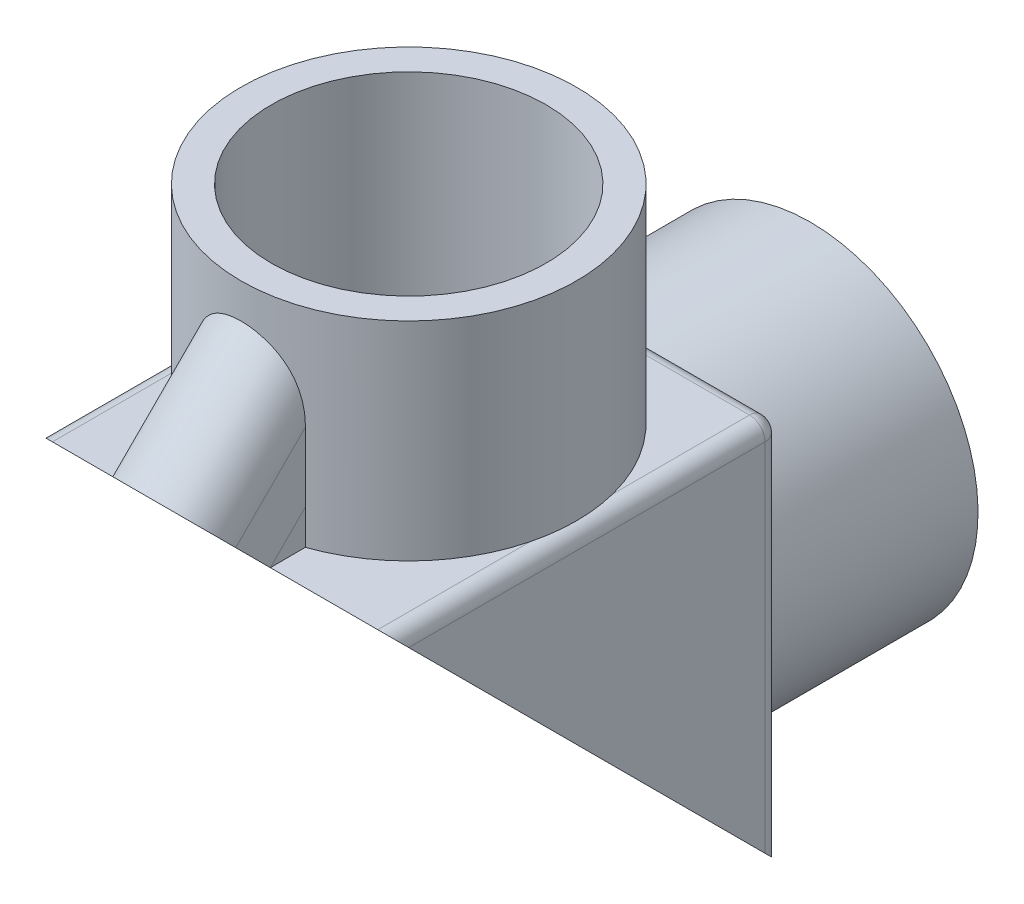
ISO-10303-21;
HEADER;
FILE_DESCRIPTION(('STEP AP214'),'2;1');
FILE_NAME('part.step','',(''),(''),'','','');
FILE_SCHEMA(('AUTOMOTIVE_DESIGN { 1 0 10303 214 1 1 1 1 }'));
ENDSEC;
DATA;
#1=APPLICATION_CONTEXT('core data for automotive mechanical design processes');
#2=APPLICATION_PROTOCOL_DEFINITION('international standard','automotive_design',2000,#1);
#3=PRODUCT_CONTEXT('',#1,'mechanical');
#4=PRODUCT('Part','Part','',(#3));
#5=PRODUCT_RELATED_PRODUCT_CATEGORY('part','',(#4));
#6=PRODUCT_DEFINITION_FORMATION('','',#4);
#7=PRODUCT_DEFINITION_CONTEXT('part definition',#1,'design');
#8=PRODUCT_DEFINITION('design','',#6,#7);
#9=PRODUCT_DEFINITION_SHAPE('','',#8);
#10=(LENGTH_UNIT() NAMED_UNIT(*) SI_UNIT(.MILLI.,.METRE.));
#11=(NAMED_UNIT(*) PLANE_ANGLE_UNIT() SI_UNIT($,.RADIAN.));
#12=(NAMED_UNIT(*) SI_UNIT($,.STERADIAN.) SOLID_ANGLE_UNIT());
#13=UNCERTAINTY_MEASURE_WITH_UNIT(LENGTH_MEASURE(1.E-05),#10,'distance_accuracy_value','');
#14=(GEOMETRIC_REPRESENTATION_CONTEXT(3) GLOBAL_UNCERTAINTY_ASSIGNED_CONTEXT((#13)) GLOBAL_UNIT_ASSIGNED_CONTEXT((#10,
#11,#12)) REPRESENTATION_CONTEXT('',''));
#15=CARTESIAN_POINT('',(0.,0.,0.));
#16=DIRECTION('',(0.,0.,1.));
#17=DIRECTION('',(1.,0.,0.));
#18=AXIS2_PLACEMENT_3D('',#15,#16,#17);
#19=CARTESIAN_POINT('',(17.526,0.,-19.05));
#20=DIRECTION('',(0.,0.,1.));
#21=DIRECTION('',(0.,-1.,0.));
#22=AXIS2_PLACEMENT_3D('',#19,#20,#21);
#23=PLANE('',#22);
#24=CARTESIAN_POINT('',(0.,0.,-19.05));
#25=DIRECTION('',(0.,0.,-1.));
#26=DIRECTION('',(0.,1.,0.));
#27=AXIS2_PLACEMENT_3D('',#24,#25,#26);
#28=CIRCLE('',#27,16.51);
#29=CARTESIAN_POINT('',(-5.4356,-15.5895590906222,-19.05));
#30=VERTEX_POINT('',#29);
#31=CARTESIAN_POINT('',(-16.002,-4.06400000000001,-19.05));
#32=VERTEX_POINT('',#31);
#33=EDGE_CURVE('E442',#30,#32,#28,.T.);
#34=ORIENTED_EDGE('',*,*,#33,.F.);
#35=DIRECTION('',(0.,-1.,0.));
#36=VECTOR('',#35,1.);
#37=CARTESIAN_POINT('',(-5.4356,0.,-19.05));
#38=LINE('',#37,#36);
#39=CARTESIAN_POINT('',(-5.4356,-19.05,-19.05));
#40=VERTEX_POINT('',#39);
#41=EDGE_CURVE('E284',#30,#40,#38,.T.);
#42=ORIENTED_EDGE('',*,*,#41,.T.);
#43=DIRECTION('',(-1.,0.,0.));
#44=VECTOR('',#43,1.);
#45=CARTESIAN_POINT('',(17.526,-19.05,-19.05));
#46=LINE('',#45,#44);
#47=CARTESIAN_POINT('',(-16.002,-19.05,-19.05));
#48=VERTEX_POINT('',#47);
#49=EDGE_CURVE('E355',#40,#48,#46,.T.);
#50=ORIENTED_EDGE('',*,*,#49,.T.);
#51=DIRECTION('',(0.,1.,0.));
#52=VECTOR('',#51,1.);
#53=CARTESIAN_POINT('',(-16.002,19.05,-19.05));
#54=LINE('',#53,#52);
#55=EDGE_CURVE('E232',#48,#32,#54,.T.);
#56=ORIENTED_EDGE('',*,*,#55,.T.);
#57=EDGE_LOOP('',(#34,#42,#50,#56));
#58=FACE_BOUND('',#57,.T.);
#59=ADVANCED_FACE('F38',(#58),#23,.F.);
#60=CARTESIAN_POINT('',(-16.002,4.06400000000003,-19.05));
#61=VERTEX_POINT('',#60);
#62=CARTESIAN_POINT('',(16.002,4.06400000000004,-19.05));
#63=VERTEX_POINT('',#62);
#64=EDGE_CURVE('E192',#61,#63,#28,.T.);
#65=ORIENTED_EDGE('',*,*,#64,.F.);
#66=CARTESIAN_POINT('',(-16.002,17.526,-19.05));
#67=VERTEX_POINT('',#66);
#68=EDGE_CURVE('E226',#61,#67,#54,.T.);
#69=ORIENTED_EDGE('',*,*,#68,.T.);
#70=DIRECTION('',(-1.,0.,0.));
#71=VECTOR('',#70,1.);
#72=CARTESIAN_POINT('',(17.526,17.526,-19.05));
#73=LINE('',#72,#71);
#74=CARTESIAN_POINT('',(16.002,17.526,-19.05));
#75=VERTEX_POINT('',#74);
#76=EDGE_CURVE('E224',#67,#75,#73,.F.);
#77=ORIENTED_EDGE('',*,*,#76,.T.);
#78=DIRECTION('',(0.,1.,0.));
#79=VECTOR('',#78,1.);
#80=CARTESIAN_POINT('',(16.002,0.,-19.05));
#81=LINE('',#80,#79);
#82=EDGE_CURVE('E216',#75,#63,#81,.F.);
#83=ORIENTED_EDGE('',*,*,#82,.T.);
#84=EDGE_LOOP('',(#65,#69,#77,#83));
#85=FACE_BOUND('',#84,.T.);
#86=ADVANCED_FACE('F222',(#85),#23,.F.);
#87=CARTESIAN_POINT('',(16.002,-4.06400000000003,-19.05));
#88=VERTEX_POINT('',#87);
#89=CARTESIAN_POINT('',(5.42419755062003,-15.5935300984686,-19.05));
#90=VERTEX_POINT('',#89);
#91=EDGE_CURVE('E210',#88,#90,#28,.T.);
#92=ORIENTED_EDGE('',*,*,#91,.F.);
#93=CARTESIAN_POINT('',(16.002,-19.05,-19.05));
#94=VERTEX_POINT('',#93);
#95=EDGE_CURVE('E218',#88,#94,#81,.F.);
#96=ORIENTED_EDGE('',*,*,#95,.T.);
#97=CARTESIAN_POINT('',(5.4356,-19.05,-19.05));
#98=VERTEX_POINT('',#97);
#99=EDGE_CURVE('E356',#94,#98,#46,.T.);
#100=ORIENTED_EDGE('',*,*,#99,.T.);
#101=DIRECTION('',(-0.00329885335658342,0.999994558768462,0.));
#102=VECTOR('',#101,1.);
#103=CARTESIAN_POINT('',(5.37288875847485,-0.0400915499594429,-19.05));
#104=LINE('',#103,#102);
#105=EDGE_CURVE('E262',#98,#90,#104,.T.);
#106=ORIENTED_EDGE('',*,*,#105,.T.);
#107=EDGE_LOOP('',(#92,#96,#100,#106));
#108=FACE_BOUND('',#107,.T.);
#109=ADVANCED_FACE('F428',(#108),#23,.F.);
#110=CARTESIAN_POINT('',(-5.4356,-10.0578868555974,-34.8433937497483));
#111=DIRECTION('',(-1.,0.,0.));
#112=DIRECTION('',(0.,0.,1.));
#113=AXIS2_PLACEMENT_3D('',#110,#111,#112);
#114=PLANE('',#113);
#115=ORIENTED_EDGE('',*,*,#41,.F.);
#116=DIRECTION('',(0.,0.,1.));
#117=VECTOR('',#116,1.);
#118=CARTESIAN_POINT('',(-5.4356,-15.5895590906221,-39.497));
#119=LINE('',#118,#117);
#120=CARTESIAN_POINT('',(-5.4356,-15.5895590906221,-29.3117215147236));
#121=VERTEX_POINT('',#120);
#122=EDGE_CURVE('E379',#30,#121,#119,.F.);
#123=ORIENTED_EDGE('',*,*,#122,.T.);
#124=DIRECTION('',(0.,-0.707106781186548,0.707106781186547));
#125=VECTOR('',#124,1.);
#126=CARTESIAN_POINT('',(-5.4356,-10.0578868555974,-34.8433937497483));
#127=LINE('',#126,#125);
#128=CARTESIAN_POINT('',(-5.4356,-22.4506403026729,-22.4506403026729));
#129=VERTEX_POINT('',#128);
#130=EDGE_CURVE('E323',#121,#129,#127,.T.);
#131=ORIENTED_EDGE('',*,*,#130,.T.);
#132=DIRECTION('',(0.,-0.707106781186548,-0.707106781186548));
#133=VECTOR('',#132,1.);
#134=CARTESIAN_POINT('',(-5.4356,-22.4506403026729,-22.4506403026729));
#135=LINE('',#134,#133);
#136=EDGE_CURVE('E319',#40,#129,#135,.T.);
#137=ORIENTED_EDGE('',*,*,#136,.F.);
#138=EDGE_LOOP('',(#115,#123,#131,#137));
#139=FACE_BOUND('',#138,.T.);
#140=ADVANCED_FACE('F435',(#139),#114,.T.);
#141=CARTESIAN_POINT('',(5.4158758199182,-3.66771191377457,-28.4532188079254));
#142=DIRECTION('',(0.999989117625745,0.00329883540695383,0.00329883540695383));
#143=DIRECTION('',(0.00329885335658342,0.,-0.999994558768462));
#144=AXIS2_PLACEMENT_3D('',#141,#142,#143);
#145=PLANE('',#144);
#146=DIRECTION('',(0.,-0.707106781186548,0.707106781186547));
#147=VECTOR('',#146,1.);
#148=CARTESIAN_POINT('',(5.4356,-6.65724655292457,-31.4427534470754));
#149=LINE('',#148,#147);
#150=CARTESIAN_POINT('',(5.4356,-15.5895590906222,-22.5104409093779));
#151=VERTEX_POINT('',#150);
#152=EDGE_CURVE('E326',#151,#98,#149,.T.);
#153=ORIENTED_EDGE('',*,*,#152,.F.);
#154=CARTESIAN_POINT('',(0.,-5.86296497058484E-13,1609.61508039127));
#155=DIRECTION('',(0.999989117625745,0.00329883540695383,0.00329883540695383));
#156=DIRECTION('',(-0.00329881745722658,-1.08823742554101E-05,0.999994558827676));
#157=AXIS2_PLACEMENT_3D('',#154,#155,#156);
#158=ELLIPSE('',#157,5004.79653067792,16.51);
#159=EDGE_CURVE('E53',#151,#90,#158,.F.);
#160=ORIENTED_EDGE('',*,*,#159,.T.);
#161=ORIENTED_EDGE('',*,*,#105,.F.);
#162=EDGE_LOOP('',(#153,#160,#161));
#163=FACE_BOUND('',#162,.T.);
#164=ADVANCED_FACE('F439',(#163),#145,.T.);
#165=CARTESIAN_POINT('',(0.,-10.0578868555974,-34.8433937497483));
#166=DIRECTION('',(0.,-0.707106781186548,0.707106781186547));
#167=DIRECTION('',(0.,-0.707106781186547,-0.707106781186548));
#168=AXIS2_PLACEMENT_3D('',#165,#166,#167);
#169=CYLINDRICAL_SURFACE('',#168,5.4356);
#170=ORIENTED_EDGE('',*,*,#130,.F.);
#171=CARTESIAN_POINT('',(-5.4356,-15.5895590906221,-29.3117215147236));
#172=CARTESIAN_POINT('',(-5.43556749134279,-15.5895406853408,-29.5403712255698));
#173=CARTESIAN_POINT('',(-5.42838212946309,-15.5920737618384,-29.769107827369));
#174=CARTESIAN_POINT('',(-5.39849313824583,-15.6024637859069,-30.2258273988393));
#175=CARTESIAN_POINT('',(-5.37576257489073,-15.6103299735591,-30.4538083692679));
#176=CARTESIAN_POINT('',(-5.31329210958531,-15.6317011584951,-30.909256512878));
#177=CARTESIAN_POINT('',(-5.27340608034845,-15.6452545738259,-31.1367019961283));
#178=CARTESIAN_POINT('',(-5.17531126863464,-15.6779749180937,-31.5869895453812));
#179=CARTESIAN_POINT('',(-5.11711540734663,-15.6971378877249,-31.8098347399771));
#180=CARTESIAN_POINT('',(-4.94511362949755,-15.75240232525,-32.3644789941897));
#181=CARTESIAN_POINT('',(-4.81815105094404,-15.7921156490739,-32.6920940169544));
#182=CARTESIAN_POINT('',(-4.59060463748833,-15.8591458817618,-33.1637758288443));
#183=CARTESIAN_POINT('',(-4.50866442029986,-15.8827075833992,-33.3175805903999));
#184=CARTESIAN_POINT('',(-4.33212866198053,-15.9317667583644,-33.6173903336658));
#185=CARTESIAN_POINT('',(-4.23753955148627,-15.9572632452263,-33.7633992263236));
#186=CARTESIAN_POINT('',(-4.03453965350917,-16.0097995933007,-34.0476390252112));
#187=CARTESIAN_POINT('',(-3.92599058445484,-16.0368531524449,-34.1857688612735));
#188=CARTESIAN_POINT('',(-3.69617254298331,-16.0913747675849,-34.4508286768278));
#189=CARTESIAN_POINT('',(-3.57491010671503,-16.1188426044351,-34.5777643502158));
#190=CARTESIAN_POINT('',(-3.32014987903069,-16.1732392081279,-34.8189370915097));
#191=CARTESIAN_POINT('',(-3.18664847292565,-16.2001678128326,-34.9331703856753));
#192=CARTESIAN_POINT('',(-2.90836635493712,-16.2524313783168,-35.1473677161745));
#193=CARTESIAN_POINT('',(-2.7635877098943,-16.2777666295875,-35.2473343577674));
#194=CARTESIAN_POINT('',(-2.48530467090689,-16.3223866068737,-35.4185577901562));
#195=CARTESIAN_POINT('',(-2.35312004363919,-16.342019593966,-35.491875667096));
#196=CARTESIAN_POINT('',(-2.08234478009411,-16.3787238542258,-35.6262978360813));
#197=CARTESIAN_POINT('',(-1.94375491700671,-16.3957954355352,-35.6874035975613));
#198=CARTESIAN_POINT('',(-1.66133506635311,-16.4268145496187,-35.7967756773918));
#199=CARTESIAN_POINT('',(-1.51750757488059,-16.4407635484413,-35.8450480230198));
#200=CARTESIAN_POINT('',(-1.22576582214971,-16.4650847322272,-35.9283204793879));
#201=CARTESIAN_POINT('',(-1.07785179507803,-16.4754571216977,-35.9633213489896));
#202=CARTESIAN_POINT('',(-0.792909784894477,-16.4915087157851,-36.0171366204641));
#203=CARTESIAN_POINT('',(-0.656124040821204,-16.4975304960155,-36.0371390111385));
#204=CARTESIAN_POINT('',(-0.38126291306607,-16.5061697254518,-36.0657618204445));
#205=CARTESIAN_POINT('',(-0.243187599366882,-16.5087873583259,-36.0743828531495));
#206=CARTESIAN_POINT('',(0.0331911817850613,-16.5105448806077,-36.080175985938));
#207=CARTESIAN_POINT('',(0.171494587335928,-16.5096855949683,-36.0773508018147));
#208=CARTESIAN_POINT('',(0.447330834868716,-16.5045152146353,-36.0602795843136));
#209=CARTESIAN_POINT('',(0.584863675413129,-16.5002041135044,-36.046033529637));
#210=CARTESIAN_POINT('',(0.854860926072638,-16.4883939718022,-36.0067086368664));
#211=CARTESIAN_POINT('',(0.987367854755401,-16.4809737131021,-35.9818972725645));
#212=CARTESIAN_POINT('',(1.2497926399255,-16.463153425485,-35.9216757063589));
#213=CARTESIAN_POINT('',(1.37970961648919,-16.4527524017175,-35.8862619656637));
#214=CARTESIAN_POINT('',(1.63596934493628,-16.4292499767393,-35.8051241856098));
#215=CARTESIAN_POINT('',(1.76231356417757,-16.4161497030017,-35.7594044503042));
#216=CARTESIAN_POINT('',(2.01070267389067,-16.3875810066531,-35.6579792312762));
#217=CARTESIAN_POINT('',(2.13274594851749,-16.3721117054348,-35.6022700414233));
#218=CARTESIAN_POINT('',(2.37328546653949,-16.3389886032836,-35.480521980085));
#219=CARTESIAN_POINT('',(2.49171478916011,-16.3213089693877,-35.4143579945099));
#220=CARTESIAN_POINT('',(2.72268021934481,-16.2843728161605,-35.272745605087));
#221=CARTESIAN_POINT('',(2.83521417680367,-16.2651157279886,-35.1972938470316));
#222=CARTESIAN_POINT('',(3.05372170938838,-16.2255111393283,-35.0377534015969));
#223=CARTESIAN_POINT('',(3.15969718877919,-16.2051639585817,-34.9536672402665));
#224=CARTESIAN_POINT('',(3.36468521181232,-16.16384644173,-34.7774787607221));
#225=CARTESIAN_POINT('',(3.46369519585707,-16.1428758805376,-34.6853735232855));
#226=CARTESIAN_POINT('',(3.65982433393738,-16.0995790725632,-34.4883893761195));
#227=CARTESIAN_POINT('',(3.75651066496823,-16.0772439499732,-34.3830810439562));
#228=CARTESIAN_POINT('',(3.94141558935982,-16.0329153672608,-34.1651875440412));
#229=CARTESIAN_POINT('',(4.02963075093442,-16.0109220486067,-34.0525994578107));
#230=CARTESIAN_POINT('',(4.28131098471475,-15.9461782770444,-33.7052347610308));
#231=CARTESIAN_POINT('',(4.43193055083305,-15.9046365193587,-33.4607358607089));
#232=CARTESIAN_POINT('',(4.65826078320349,-15.8395071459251,-33.0305836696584));
#233=CARTESIAN_POINT('',(4.74281754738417,-15.8143034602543,-32.8496721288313));
#234=CARTESIAN_POINT('',(4.89613595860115,-15.7675105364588,-32.4807255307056));
#235=CARTESIAN_POINT('',(4.96489172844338,-15.7459226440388,-32.2926878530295));
#236=CARTESIAN_POINT('',(5.08745704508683,-15.706751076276,-31.9109631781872));
#237=CARTESIAN_POINT('',(5.14123203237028,-15.6891766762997,-31.7172642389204));
#238=CARTESIAN_POINT('',(5.23454758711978,-15.6582888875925,-31.3261179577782));
#239=CARTESIAN_POINT('',(5.27408405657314,-15.6449767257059,-31.1286695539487));
#240=CARTESIAN_POINT('',(5.35127031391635,-15.6187790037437,-30.662101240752));
#241=CARTESIAN_POINT('',(5.38346941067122,-15.6076560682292,-30.3919650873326));
#242=CARTESIAN_POINT('',(5.41506943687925,-15.5967051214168,-29.9863874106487));
#243=CARTESIAN_POINT('',(5.42282131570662,-15.5940099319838,-29.8515873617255));
#244=CARTESIAN_POINT('',(5.43308392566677,-15.590436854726,-29.5817703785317));
#245=CARTESIAN_POINT('',(5.43559497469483,-15.5895588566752,-29.4467534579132));
#246=CARTESIAN_POINT('',(5.4356,-15.5895590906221,-29.3117215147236));
#247=B_SPLINE_CURVE_WITH_KNOTS('',3,(#171,#172,#173,#174,#175,#176,#177,#178,#179,#180,#181,
#182,#183,#184,#185,#186,#187,#188,#189,#190,#191,#192,#193,#194,#195,#196,#197,#198,#199,#200,
#201,#202,#203,#204,#205,#206,#207,#208,#209,#210,#211,#212,#213,#214,#215,#216,#217,#218,#219,
#220,#221,#222,#223,#224,#225,#226,#227,#228,#229,#230,#231,#232,#233,#234,#235,#236,#237,#238,
#239,#240,#241,#242,#243,#244,#245,#246),.UNSPECIFIED.,.F.,.F.,(4,2,2,2,2,2,2,2,2,2,2,2,2,2,2,2,
2,2,2,2,2,2,2,2,2,2,2,2,2,2,2,2,2,2,2,2,2,4),(0.,0.68594893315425,1.37308938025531,
2.0662024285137,2.75882744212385,3.81487612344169,4.3419320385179,4.86872101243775,
5.40120111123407,5.93340878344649,6.4657741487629,6.99804217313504,7.45470328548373,
7.91130941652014,8.36770071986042,8.8240659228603,9.23867543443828,9.65326257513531,
10.0677513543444,10.4822409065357,10.8868085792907,11.2915114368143,11.6960455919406,
12.1007301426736,12.5106866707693,12.9207916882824,13.3307770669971,13.7409123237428,
14.1745297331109,14.608322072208,15.4753928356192,16.0785345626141,16.6819002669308,
17.2866465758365,17.8915667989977,18.7071247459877,19.1121835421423,19.5172177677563),.UNSPECIFIED.);
#248=CARTESIAN_POINT('',(5.4356,-15.5895590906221,-29.3117215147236));
#249=VERTEX_POINT('',#248);
#250=EDGE_CURVE('E446',#121,#249,#247,.T.);
#251=ORIENTED_EDGE('',*,*,#250,.T.);
#252=DIRECTION('',(0.,-0.707106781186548,0.707106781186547));
#253=VECTOR('',#252,1.);
#254=CARTESIAN_POINT('',(5.4356,-10.0578868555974,-34.8433937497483));
#255=LINE('',#254,#253);
#256=CARTESIAN_POINT('',(5.4356,-22.4506403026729,-22.4506403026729));
#257=VERTEX_POINT('',#256);
#258=EDGE_CURVE('E322',#249,#257,#255,.T.);
#259=ORIENTED_EDGE('',*,*,#258,.T.);
#260=CARTESIAN_POINT('',(0.,-22.4506403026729,-22.4506403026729));
#261=DIRECTION('',(0.,-0.707106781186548,0.707106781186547));
#262=DIRECTION('',(0.,-0.707106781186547,-0.707106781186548));
#263=AXIS2_PLACEMENT_3D('',#260,#261,#262);
#264=CIRCLE('',#263,5.4356);
#265=EDGE_CURVE('E308',#129,#257,#264,.T.);
#266=ORIENTED_EDGE('',*,*,#265,.F.);
#267=EDGE_LOOP('',(#170,#251,#259,#266));
#268=FACE_BOUND('',#267,.T.);
#269=ADVANCED_FACE('F454',(#268),#169,.T.);
#270=CARTESIAN_POINT('',(5.4356,-10.0578868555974,-34.8433937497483));
#271=DIRECTION('',(1.,0.,0.));
#272=DIRECTION('',(0.,0.,-1.));
#273=AXIS2_PLACEMENT_3D('',#270,#271,#272);
#274=PLANE('',#273);
#275=ORIENTED_EDGE('',*,*,#258,.F.);
#276=DIRECTION('',(0.,0.,1.));
#277=VECTOR('',#276,1.);
#278=CARTESIAN_POINT('',(5.4356,-15.5895590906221,-39.497));
#279=LINE('',#278,#277);
#280=EDGE_CURVE('E11',#249,#151,#279,.T.);
#281=ORIENTED_EDGE('',*,*,#280,.T.);
#282=ORIENTED_EDGE('',*,*,#152,.T.);
#283=DIRECTION('',(0.,0.707106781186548,0.707106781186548));
#284=VECTOR('',#283,1.);
#285=CARTESIAN_POINT('',(5.4356,-22.4506403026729,-22.4506403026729));
#286=LINE('',#285,#284);
#287=EDGE_CURVE('E316',#257,#98,#286,.T.);
#288=ORIENTED_EDGE('',*,*,#287,.F.);
#289=EDGE_LOOP('',(#275,#281,#282,#288));
#290=FACE_BOUND('',#289,.T.);
#291=ADVANCED_FACE('F682',(#290),#274,.T.);
#292=CARTESIAN_POINT('',(17.526,19.05,0.));
#293=DIRECTION('',(0.,-1.,0.));
#294=DIRECTION('',(0.,0.,-1.));
#295=AXIS2_PLACEMENT_3D('',#292,#293,#294);
#296=PLANE('',#295);
#297=CARTESIAN_POINT('',(0.,19.05,0.));
#298=DIRECTION('',(0.,1.,0.));
#299=DIRECTION('',(0.,0.,1.));
#300=AXIS2_PLACEMENT_3D('',#297,#298,#299);
#301=CIRCLE('',#300,16.51);
#302=CARTESIAN_POINT('',(-16.002,19.05,4.06400000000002));
#303=VERTEX_POINT('',#302);
#304=CARTESIAN_POINT('',(-5.4356,19.05,15.5895590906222));
#305=VERTEX_POINT('',#304);
#306=EDGE_CURVE('E219',#303,#305,#301,.T.);
#307=ORIENTED_EDGE('',*,*,#306,.F.);
#308=DIRECTION('',(0.,0.,1.));
#309=VECTOR('',#308,1.);
#310=CARTESIAN_POINT('',(-16.002,19.05,19.05));
#311=LINE('',#310,#309);
#312=CARTESIAN_POINT('',(-16.002,19.05,19.05));
#313=VERTEX_POINT('',#312);
#314=EDGE_CURVE('E254',#303,#313,#311,.T.);
#315=ORIENTED_EDGE('',*,*,#314,.T.);
#316=DIRECTION('',(-1.,0.,0.));
#317=VECTOR('',#316,1.);
#318=CARTESIAN_POINT('',(17.526,19.05,19.05));
#319=LINE('',#318,#317);
#320=CARTESIAN_POINT('',(-5.4356,19.05,19.05));
#321=VERTEX_POINT('',#320);
#322=EDGE_CURVE('E358',#321,#313,#319,.T.);
#323=ORIENTED_EDGE('',*,*,#322,.F.);
#324=DIRECTION('',(0.,0.,-1.));
#325=VECTOR('',#324,1.);
#326=CARTESIAN_POINT('',(-5.4356,19.05,0.));
#327=LINE('',#326,#325);
#328=EDGE_CURVE('E288',#321,#305,#327,.T.);
#329=ORIENTED_EDGE('',*,*,#328,.T.);
#330=EDGE_LOOP('',(#307,#315,#323,#329));
#331=FACE_BOUND('',#330,.T.);
#332=ADVANCED_FACE('F425',(#331),#296,.F.);
#333=CARTESIAN_POINT('',(5.42419755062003,19.05,15.5935300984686));
#334=VERTEX_POINT('',#333);
#335=CARTESIAN_POINT('',(16.002,19.05,4.06400000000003));
#336=VERTEX_POINT('',#335);
#337=EDGE_CURVE('E388',#334,#336,#301,.T.);
#338=ORIENTED_EDGE('',*,*,#337,.F.);
#339=DIRECTION('',(0.00329885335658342,0.,0.999994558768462));
#340=VECTOR('',#339,1.);
#341=CARTESIAN_POINT('',(5.37288875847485,19.05,0.0400915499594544));
#342=LINE('',#341,#340);
#343=CARTESIAN_POINT('',(5.4356,19.05,19.05));
#344=VERTEX_POINT('',#343);
#345=EDGE_CURVE('E286',#334,#344,#342,.T.);
#346=ORIENTED_EDGE('',*,*,#345,.T.);
#347=CARTESIAN_POINT('',(16.002,19.05,19.05));
#348=VERTEX_POINT('',#347);
#349=EDGE_CURVE('E228',#348,#344,#319,.T.);
#350=ORIENTED_EDGE('',*,*,#349,.F.);
#351=DIRECTION('',(0.,0.,1.));
#352=VECTOR('',#351,1.);
#353=CARTESIAN_POINT('',(16.002,19.05,0.));
#354=LINE('',#353,#352);
#355=EDGE_CURVE('E249',#348,#336,#354,.F.);
#356=ORIENTED_EDGE('',*,*,#355,.T.);
#357=EDGE_LOOP('',(#338,#346,#350,#356));
#358=FACE_BOUND('',#357,.T.);
#359=ADVANCED_FACE('F422',(#358),#296,.F.);
#360=CARTESIAN_POINT('',(16.002,19.05,-4.06400000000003));
#361=VERTEX_POINT('',#360);
#362=CARTESIAN_POINT('',(-16.002,19.05,-4.06400000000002));
#363=VERTEX_POINT('',#362);
#364=EDGE_CURVE('E624',#361,#363,#301,.T.);
#365=ORIENTED_EDGE('',*,*,#364,.F.);
#366=CARTESIAN_POINT('',(16.002,19.05,-17.526));
#367=VERTEX_POINT('',#366);
#368=EDGE_CURVE('E248',#361,#367,#354,.F.);
#369=ORIENTED_EDGE('',*,*,#368,.T.);
#370=DIRECTION('',(-1.,0.,0.));
#371=VECTOR('',#370,1.);
#372=CARTESIAN_POINT('',(17.526,19.05,-17.526));
#373=LINE('',#372,#371);
#374=CARTESIAN_POINT('',(-16.002,19.05,-17.526));
#375=VERTEX_POINT('',#374);
#376=EDGE_CURVE('E252',#367,#375,#373,.T.);
#377=ORIENTED_EDGE('',*,*,#376,.T.);
#378=EDGE_CURVE('E255',#375,#363,#311,.T.);
#379=ORIENTED_EDGE('',*,*,#378,.T.);
#380=EDGE_LOOP('',(#365,#369,#377,#379));
#381=FACE_BOUND('',#380,.T.);
#382=ADVANCED_FACE('F414',(#381),#296,.F.);
#383=CARTESIAN_POINT('',(-5.4356,31.4427534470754,6.65724655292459));
#384=DIRECTION('',(-1.,0.,0.));
#385=DIRECTION('',(0.,0.,1.));
#386=AXIS2_PLACEMENT_3D('',#383,#384,#385);
#387=PLANE('',#386);
#388=DIRECTION('',(0.,-0.707106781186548,0.707106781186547));
#389=VECTOR('',#388,1.);
#390=CARTESIAN_POINT('',(-5.4356,34.8433937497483,10.0578868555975));
#391=LINE('',#390,#389);
#392=CARTESIAN_POINT('',(-5.4356,29.3117215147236,15.5895590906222));
#393=VERTEX_POINT('',#392);
#394=CARTESIAN_POINT('',(-5.4356,22.4506403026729,22.4506403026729));
#395=VERTEX_POINT('',#394);
#396=EDGE_CURVE('E306',#393,#395,#391,.T.);
#397=ORIENTED_EDGE('',*,*,#396,.F.);
#398=DIRECTION('',(0.,-1.,0.));
#399=VECTOR('',#398,1.);
#400=CARTESIAN_POINT('',(-5.4356,39.497,15.5895590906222));
#401=LINE('',#400,#399);
#402=EDGE_CURVE('E606',#393,#305,#401,.T.);
#403=ORIENTED_EDGE('',*,*,#402,.T.);
#404=ORIENTED_EDGE('',*,*,#328,.F.);
#405=DIRECTION('',(0.,-0.707106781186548,-0.707106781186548));
#406=VECTOR('',#405,1.);
#407=CARTESIAN_POINT('',(-5.4356,19.05,19.05));
#408=LINE('',#407,#406);
#409=EDGE_CURVE('E310',#395,#321,#408,.T.);
#410=ORIENTED_EDGE('',*,*,#409,.F.);
#411=EDGE_LOOP('',(#397,#403,#404,#410));
#412=FACE_BOUND('',#411,.T.);
#413=ADVANCED_FACE('F411',(#412),#387,.T.);
#414=CARTESIAN_POINT('',(5.4158758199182,28.4532188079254,3.66771191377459));
#415=DIRECTION('',(0.999989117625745,-0.00329883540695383,-0.00329883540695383));
#416=DIRECTION('',(-0.00329885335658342,0.,-0.999994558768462));
#417=AXIS2_PLACEMENT_3D('',#414,#415,#416);
#418=PLANE('',#417);
#419=ORIENTED_EDGE('',*,*,#345,.F.);
#420=CARTESIAN_POINT('',(0.,-1609.61508039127,0.));
#421=DIRECTION('',(0.999989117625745,-0.00329883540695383,-0.00329883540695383));
#422=DIRECTION('',(-0.00329881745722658,-0.999994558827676,1.08823742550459E-05));
#423=AXIS2_PLACEMENT_3D('',#420,#421,#422);
#424=ELLIPSE('',#423,5004.79653067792,16.51);
#425=CARTESIAN_POINT('',(5.4356,22.5104409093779,15.5895590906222));
#426=VERTEX_POINT('',#425);
#427=EDGE_CURVE('E398',#334,#426,#424,.F.);
#428=ORIENTED_EDGE('',*,*,#427,.T.);
#429=DIRECTION('',(0.,-0.707106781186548,0.707106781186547));
#430=VECTOR('',#429,1.);
#431=CARTESIAN_POINT('',(5.4356,31.4427534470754,6.65724655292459));
#432=LINE('',#431,#430);
#433=EDGE_CURVE('E298',#426,#344,#432,.T.);
#434=ORIENTED_EDGE('',*,*,#433,.T.);
#435=EDGE_LOOP('',(#419,#428,#434));
#436=FACE_BOUND('',#435,.T.);
#437=ADVANCED_FACE('F413',(#436),#418,.T.);
#438=CARTESIAN_POINT('',(0.,34.8433937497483,10.0578868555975));
#439=DIRECTION('',(0.,-0.707106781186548,0.707106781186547));
#440=DIRECTION('',(0.,-0.707106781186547,-0.707106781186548));
#441=AXIS2_PLACEMENT_3D('',#438,#439,#440);
#442=CYLINDRICAL_SURFACE('',#441,5.4356);
#443=DIRECTION('',(0.,-0.707106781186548,0.707106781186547));
#444=VECTOR('',#443,1.);
#445=CARTESIAN_POINT('',(5.4356,34.8433937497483,10.0578868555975));
#446=LINE('',#445,#444);
#447=CARTESIAN_POINT('',(5.4356,29.3117215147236,15.5895590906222));
#448=VERTEX_POINT('',#447);
#449=CARTESIAN_POINT('',(5.4356,22.4506403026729,22.4506403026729));
#450=VERTEX_POINT('',#449);
#451=EDGE_CURVE('E295',#448,#450,#446,.T.);
#452=ORIENTED_EDGE('',*,*,#451,.F.);
#453=CARTESIAN_POINT('',(0.,20.7041813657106,16.51));
#454=CARTESIAN_POINT('',(0.0915489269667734,20.7041801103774,16.5100002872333));
#455=CARTESIAN_POINT('',(0.183086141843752,20.7082243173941,16.5092361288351));
#456=CARTESIAN_POINT('',(0.365442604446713,20.7242779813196,16.5062074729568));
#457=CARTESIAN_POINT('',(0.456261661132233,20.736289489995,16.503942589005));
#458=CARTESIAN_POINT('',(0.72676991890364,20.7839240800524,16.4949795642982));
#459=CARTESIAN_POINT('',(0.904439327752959,20.8311469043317,16.4861131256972));
#460=CARTESIAN_POINT('',(1.28875461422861,20.9661193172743,16.4609940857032));
#461=CARTESIAN_POINT('',(1.49290322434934,21.0606052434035,16.4435269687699));
#462=CARTESIAN_POINT('',(1.88300800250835,21.2808657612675,16.4034458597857));
#463=CARTESIAN_POINT('',(2.06893162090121,21.4066949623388,16.3808228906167));
#464=CARTESIAN_POINT('',(2.37865956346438,21.6479001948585,16.3383036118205));
#465=CARTESIAN_POINT('',(2.50653140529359,21.7582991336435,16.319094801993));
#466=CARTESIAN_POINT('',(2.75206137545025,21.9898112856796,16.2794880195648));
#467=CARTESIAN_POINT('',(2.86971414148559,22.1109300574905,16.2590894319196));
#468=CARTESIAN_POINT('',(3.09548555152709,22.3619524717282,16.2176221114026));
#469=CARTESIAN_POINT('',(3.2035878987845,22.4918704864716,16.19655231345));
#470=CARTESIAN_POINT('',(3.41069286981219,22.7587600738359,16.1542079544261));
#471=CARTESIAN_POINT('',(3.50969238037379,22.8957340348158,16.1329333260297));
#472=CARTESIAN_POINT('',(3.75947294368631,23.2645349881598,16.0770575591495));
#473=CARTESIAN_POINT('',(3.90310451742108,23.5012427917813,16.0425932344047));
#474=CARTESIAN_POINT('',(4.16962333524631,23.9863366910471,15.975393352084));
#475=CARTESIAN_POINT('',(4.29249755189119,24.2347299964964,15.9426588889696));
#476=CARTESIAN_POINT('',(4.51905153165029,24.7408467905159,15.8799274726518));
#477=CARTESIAN_POINT('',(4.62270395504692,24.9985829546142,15.8499344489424));
#478=CARTESIAN_POINT('',(4.81145623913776,25.5210638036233,15.7936592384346));
#479=CARTESIAN_POINT('',(4.89655990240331,25.7858070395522,15.7673762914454));
#480=CARTESIAN_POINT('',(5.05251843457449,26.334661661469,15.7181165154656));
#481=CARTESIAN_POINT('',(5.12241242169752,26.6190678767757,15.6953800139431));
#482=CARTESIAN_POINT('',(5.24193461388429,27.192569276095,15.6558673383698));
#483=CARTESIAN_POINT('',(5.29155965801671,27.4816651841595,15.6390920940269));
#484=CARTESIAN_POINT('',(5.36971671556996,28.0626570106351,15.6124292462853));
#485=CARTESIAN_POINT('',(5.39827528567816,28.3545489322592,15.6025329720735));
#486=CARTESIAN_POINT('',(5.43307169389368,28.9397993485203,15.5904521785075));
#487=CARTESIAN_POINT('',(5.43931620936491,29.2331573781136,15.5882653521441));
#488=CARTESIAN_POINT('',(5.42900653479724,29.7498592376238,15.591856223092));
#489=CARTESIAN_POINT('',(5.41750434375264,29.9733207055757,15.5958693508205));
#490=CARTESIAN_POINT('',(5.37938652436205,30.4188244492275,15.6090589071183));
#491=CARTESIAN_POINT('',(5.35277135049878,30.6408667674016,15.6182351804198));
#492=CARTESIAN_POINT('',(5.28329017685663,31.0818922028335,15.6418767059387));
#493=CARTESIAN_POINT('',(5.24044365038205,31.3008786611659,15.6563356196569));
#494=CARTESIAN_POINT('',(5.1373146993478,31.7341996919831,15.6904749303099));
#495=CARTESIAN_POINT('',(5.07703628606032,31.9485353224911,15.7101541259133));
#496=CARTESIAN_POINT('',(4.89762568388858,32.4920769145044,15.7672746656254));
#497=CARTESIAN_POINT('',(4.76457318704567,32.816581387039,15.8084269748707));
#498=CARTESIAN_POINT('',(4.52753468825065,33.2829668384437,15.8772834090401));
#499=CARTESIAN_POINT('',(4.44223553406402,33.4350921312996,15.9014350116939));
#500=CARTESIAN_POINT('',(4.25891493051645,33.7311319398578,15.9515143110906));
#501=CARTESIAN_POINT('',(4.16090011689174,33.8750506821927,15.9774410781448));
#502=CARTESIAN_POINT('',(3.95111733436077,34.1545096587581,16.030613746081));
#503=CARTESIAN_POINT('',(3.83922415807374,34.289954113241,16.0578700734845));
#504=CARTESIAN_POINT('',(3.60282831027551,34.5492194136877,16.1125550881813));
#505=CARTESIAN_POINT('',(3.47833221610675,34.6730462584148,16.1399836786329));
#506=CARTESIAN_POINT('',(3.21738236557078,34.9075212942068,16.194020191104));
#507=CARTESIAN_POINT('',(3.08093245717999,35.0181736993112,16.2206283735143));
#508=CARTESIAN_POINT('',(2.79705469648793,35.2248563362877,16.2719810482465));
#509=CARTESIAN_POINT('',(2.6496289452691,35.3208893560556,16.2967258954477));
#510=CARTESIAN_POINT('',(2.36796712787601,35.4838401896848,16.3398281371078));
#511=CARTESIAN_POINT('',(2.23506409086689,35.5529644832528,16.3585870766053));
#512=CARTESIAN_POINT('',(1.96327576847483,35.6790459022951,16.3934257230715));
#513=CARTESIAN_POINT('',(1.82439123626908,35.7360045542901,16.4095057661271));
#514=CARTESIAN_POINT('',(1.54179451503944,35.8371891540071,16.4384651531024));
#515=CARTESIAN_POINT('',(1.39808416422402,35.8814198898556,16.4513457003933));
#516=CARTESIAN_POINT('',(1.10699089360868,35.9567564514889,16.4734929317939));
#517=CARTESIAN_POINT('',(0.959608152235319,35.987862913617,16.4827597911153));
#518=CARTESIAN_POINT('',(0.675259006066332,36.0345590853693,16.4967455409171));
#519=CARTESIAN_POINT('',(0.538488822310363,36.0512545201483,16.5017874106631));
#520=CARTESIAN_POINT('',(0.263906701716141,36.0733207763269,16.5084619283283));
#521=CARTESIAN_POINT('',(0.126094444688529,36.0786879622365,16.5100934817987));
#522=CARTESIAN_POINT('',(-0.149417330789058,36.0780445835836,16.5098982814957));
#523=CARTESIAN_POINT('',(-0.287116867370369,36.0720408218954,16.5080735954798));
#524=CARTESIAN_POINT('',(-0.561516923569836,36.0487109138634,16.501019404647));
#525=CARTESIAN_POINT('',(-0.698217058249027,36.031380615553,16.4957886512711));
#526=CARTESIAN_POINT('',(-0.966708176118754,35.9860100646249,16.4822105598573));
#527=CARTESIAN_POINT('',(-1.09854197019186,35.9582023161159,16.4739309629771));
#528=CARTESIAN_POINT('',(-1.35937070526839,35.8920571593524,16.4544620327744));
#529=CARTESIAN_POINT('',(-1.48836461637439,35.8537159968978,16.4432716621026));
#530=CARTESIAN_POINT('',(-1.74254012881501,35.766818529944,16.418281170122));
#531=CARTESIAN_POINT('',(-1.8677233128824,35.7182665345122,16.4044821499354));
#532=CARTESIAN_POINT('',(-2.11357110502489,35.6112926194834,16.3746223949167));
#533=CARTESIAN_POINT('',(-2.2342340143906,35.5528670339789,16.358560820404));
#534=CARTESIAN_POINT('',(-2.47209485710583,35.4256318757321,16.3243226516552));
#535=CARTESIAN_POINT('',(-2.58920979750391,35.3566750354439,16.306117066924));
#536=CARTESIAN_POINT('',(-2.81734157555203,35.2095960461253,16.2682532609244));
#537=CARTESIAN_POINT('',(-2.92835618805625,35.13147058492,16.2485945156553));
#538=CARTESIAN_POINT('',(-3.14364829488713,34.9667270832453,16.2083178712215));
#539=CARTESIAN_POINT('',(-3.24792778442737,34.8801115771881,16.1877002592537));
#540=CARTESIAN_POINT('',(-3.44937789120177,34.6990259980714,16.1459740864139));
#541=CARTESIAN_POINT('',(-3.54654589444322,34.6045530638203,16.1248653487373));
#542=CARTESIAN_POINT('',(-3.73914116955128,34.4024902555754,16.0813327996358));
#543=CARTESIAN_POINT('',(-3.83409756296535,34.2944514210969,16.0589076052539));
#544=CARTESIAN_POINT('',(-4.01539002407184,34.0712546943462,16.0145384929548));
#545=CARTESIAN_POINT('',(-4.10172260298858,33.9560939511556,15.9925947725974));
#546=CARTESIAN_POINT('',(-4.34760803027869,33.6012350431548,15.9281902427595));
#547=CARTESIAN_POINT('',(-4.49413246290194,33.3520709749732,15.8871363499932));
#548=CARTESIAN_POINT('',(-4.71435143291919,32.9126150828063,15.8228916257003));
#549=CARTESIAN_POINT('',(-4.79675682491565,32.7267843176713,15.7980144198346));
#550=CARTESIAN_POINT('',(-4.94538121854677,32.3482106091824,15.7521226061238));
#551=CARTESIAN_POINT('',(-5.01159501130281,32.1554654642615,15.7311092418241));
#552=CARTESIAN_POINT('',(-5.12872451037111,31.7646783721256,15.6933131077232));
#553=CARTESIAN_POINT('',(-5.17961499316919,31.5666282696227,15.6765373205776));
#554=CARTESIAN_POINT('',(-5.26691837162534,31.1670731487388,15.6474206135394));
#555=CARTESIAN_POINT('',(-5.30333079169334,30.9655680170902,15.6350798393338));
#556=CARTESIAN_POINT('',(-5.37350308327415,30.4860787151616,15.6111324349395));
#557=CARTESIAN_POINT('',(-5.40139921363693,30.2071330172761,15.6014527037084));
#558=CARTESIAN_POINT('',(-5.43416526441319,29.6477180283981,15.5900676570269));
#559=CARTESIAN_POINT('',(-5.43902623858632,29.3672481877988,15.5883654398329));
#560=CARTESIAN_POINT('',(-5.42755419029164,28.8064343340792,15.5923630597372));
#561=CARTESIAN_POINT('',(-5.41119111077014,28.5260910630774,15.5980733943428));
#562=CARTESIAN_POINT('',(-5.35863888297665,27.967555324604,15.6162047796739));
#563=CARTESIAN_POINT('',(-5.32245208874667,27.6893626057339,15.6286250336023));
#564=CARTESIAN_POINT('',(-5.22987115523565,27.1283721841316,15.6598532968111));
#565=CARTESIAN_POINT('',(-5.17291855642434,26.8456767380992,15.6788370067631));
#566=CARTESIAN_POINT('',(-5.03951450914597,26.2853019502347,15.7222236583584));
#567=CARTESIAN_POINT('',(-4.96305994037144,26.0076234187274,15.7466274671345));
#568=CARTESIAN_POINT('',(-4.79071817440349,25.459170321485,15.7999129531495));
#569=CARTESIAN_POINT('',(-4.69485468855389,25.1883877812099,15.8287891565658));
#570=CARTESIAN_POINT('',(-4.48304074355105,24.655253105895,15.8900796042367));
#571=CARTESIAN_POINT('',(-4.36709789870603,24.3928978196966,15.92249250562));
#572=CARTESIAN_POINT('',(-4.15740423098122,23.9673893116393,15.9782179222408));
#573=CARTESIAN_POINT('',(-4.06972544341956,23.8011367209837,16.0008285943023));
#574=CARTESIAN_POINT('',(-3.88465364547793,23.4742467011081,16.04676497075));
#575=CARTESIAN_POINT('',(-3.78726267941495,23.3136080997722,16.0700905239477));
#576=CARTESIAN_POINT('',(-3.58216833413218,22.9992063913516,16.117048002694));
#577=CARTESIAN_POINT('',(-3.47447153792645,22.8454389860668,16.1406797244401));
#578=CARTESIAN_POINT('',(-3.24799213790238,22.546328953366,16.1877734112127));
#579=CARTESIAN_POINT('',(-3.12921297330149,22.4009837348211,16.2112354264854));
#580=CARTESIAN_POINT('',(-2.82627391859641,22.0607426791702,16.2673049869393));
#581=CARTESIAN_POINT('',(-2.6358689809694,21.8712216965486,16.299535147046));
#582=CARTESIAN_POINT('',(-2.22851722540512,21.5223713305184,16.3601976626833));
#583=CARTESIAN_POINT('',(-2.01161413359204,21.3629932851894,16.3886361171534));
#584=CARTESIAN_POINT('',(-1.61292645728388,21.1242065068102,16.4318925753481));
#585=CARTESIAN_POINT('',(-1.43739897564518,21.0348193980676,16.4483164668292));
#586=CARTESIAN_POINT('',(-1.16506093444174,20.9225807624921,16.469093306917));
#587=CARTESIAN_POINT('',(-1.07283560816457,20.88882283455,16.4753729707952));
#588=CARTESIAN_POINT('',(-0.885781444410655,20.8292589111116,16.4864870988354));
#589=CARTESIAN_POINT('',(-0.790953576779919,20.8034499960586,16.4913220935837));
#590=CARTESIAN_POINT('',(-0.581219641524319,20.7563700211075,16.5001595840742));
#591=CARTESIAN_POINT('',(-0.465895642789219,20.7368689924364,16.5038338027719));
#592=CARTESIAN_POINT('',(-0.233708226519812,20.7107744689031,16.5087540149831));
#593=CARTESIAN_POINT('',(-0.116844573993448,20.7041829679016,16.509999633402));
#594=CARTESIAN_POINT('',(0.,20.7041813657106,16.51));
#595=B_SPLINE_CURVE_WITH_KNOTS('',3,(#453,#454,#455,#456,#457,#458,#459,#460,#461,#462,#463,
#464,#465,#466,#467,#468,#469,#470,#471,#472,#473,#474,#475,#476,#477,#478,#479,#480,#481,#482,
#483,#484,#485,#486,#487,#488,#489,#490,#491,#492,#493,#494,#495,#496,#497,#498,#499,#500,#501,
#502,#503,#504,#505,#506,#507,#508,#509,#510,#511,#512,#513,#514,#515,#516,#517,#518,#519,#520,
#521,#522,#523,#524,#525,#526,#527,#528,#529,#530,#531,#532,#533,#534,#535,#536,#537,#538,#539,
#540,#541,#542,#543,#544,#545,#546,#547,#548,#549,#550,#551,#552,#553,#554,#555,#556,#557,#558,
#559,#560,#561,#562,#563,#564,#565,#566,#567,#568,#569,#570,#571,#572,#573,#574,#575,#576,#577,
#578,#579,#580,#581,#582,#583,#584,#585,#586,#587,#588,#589,#590,#591,#592,#593,#594),
.UNSPECIFIED.,.T.,.F.,(4,2,2,2,2,2,2,2,2,2,2,2,2,2,2,2,2,2,2,2,2,2,2,2,2,2,2,2,2,2,2,2,2,2,2,2,
2,2,2,2,2,2,2,2,2,2,2,2,2,2,2,2,2,2,2,2,2,2,2,2,2,2,2,2,2,2,2,2,2,2,4),(0.,0.274527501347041,
0.549125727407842,1.09853183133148,1.77179600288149,2.44624150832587,2.95564266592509,
3.46530952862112,3.97582992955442,4.48652428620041,5.32227928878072,6.15855688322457,
6.99601496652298,7.83330120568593,8.71375688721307,9.59434982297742,10.473830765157,
11.3530485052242,12.0239158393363,12.6947629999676,13.3648078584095,14.0346986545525,
15.0892017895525,15.6168899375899,16.1443038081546,16.6768791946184,17.2091780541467,
17.7413061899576,18.2733327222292,18.7256513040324,19.1779130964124,19.630004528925,
20.0820740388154,20.4952056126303,20.90846974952,21.3214867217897,21.7346551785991,
22.1391488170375,22.543786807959,22.9482543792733,23.3528724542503,23.7637787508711,
24.1748339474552,24.5857668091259,24.9968499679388,25.4331037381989,25.8695332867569,
26.7420239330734,27.3557023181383,27.9695778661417,28.5844584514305,29.1993592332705,
30.0396333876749,30.8802338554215,31.7220260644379,32.5637183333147,33.4299535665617,
34.2963274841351,35.1616492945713,36.0266436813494,36.5942922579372,37.1618216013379,
37.7289908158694,38.2959846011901,39.1053302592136,39.913357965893,40.5039404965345,
40.7988550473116,41.093661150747,41.4439885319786,41.794370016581),.UNSPECIFIED.);
#596=EDGE_CURVE('E60',#448,#393,#595,.T.);
#597=ORIENTED_EDGE('',*,*,#596,.T.);
#598=ORIENTED_EDGE('',*,*,#396,.T.);
#599=CARTESIAN_POINT('',(0.,22.4506403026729,22.4506403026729));
#600=DIRECTION('',(0.,-0.707106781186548,0.707106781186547));
#601=DIRECTION('',(0.,0.707106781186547,0.707106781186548));
#602=AXIS2_PLACEMENT_3D('',#599,#600,#601);
#603=CIRCLE('',#602,5.4356);
#604=EDGE_CURVE('E304',#450,#395,#603,.T.);
#605=ORIENTED_EDGE('',*,*,#604,.F.);
#606=EDGE_LOOP('',(#452,#597,#598,#605));
#607=FACE_BOUND('',#606,.T.);
#608=ADVANCED_FACE('F301',(#607),#442,.T.);
#609=CARTESIAN_POINT('',(5.4356,34.8433937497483,10.0578868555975));
#610=DIRECTION('',(1.,0.,0.));
#611=DIRECTION('',(0.,0.,-1.));
#612=AXIS2_PLACEMENT_3D('',#609,#610,#611);
#613=PLANE('',#612);
#614=ORIENTED_EDGE('',*,*,#433,.F.);
#615=DIRECTION('',(0.,-1.,0.));
#616=VECTOR('',#615,1.);
#617=CARTESIAN_POINT('',(5.4356,39.497,15.5895590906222));
#618=LINE('',#617,#616);
#619=EDGE_CURVE('E46',#426,#448,#618,.F.);
#620=ORIENTED_EDGE('',*,*,#619,.T.);
#621=ORIENTED_EDGE('',*,*,#451,.T.);
#622=DIRECTION('',(0.,0.707106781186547,0.707106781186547));
#623=VECTOR('',#622,1.);
#624=CARTESIAN_POINT('',(5.4356,22.4506403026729,22.4506403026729));
#625=LINE('',#624,#623);
#626=EDGE_CURVE('E594',#344,#450,#625,.T.);
#627=ORIENTED_EDGE('',*,*,#626,.F.);
#628=EDGE_LOOP('',(#614,#620,#621,#627));
#629=FACE_BOUND('',#628,.T.);
#630=ADVANCED_FACE('F293',(#629),#613,.T.);
#631=CARTESIAN_POINT('',(17.526,19.05,19.05));
#632=DIRECTION('',(0.,0.707106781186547,-0.707106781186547));
#633=DIRECTION('',(0.,0.707106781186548,0.707106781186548));
#634=AXIS2_PLACEMENT_3D('',#631,#632,#633);
#635=PLANE('',#634);
#636=ORIENTED_EDGE('',*,*,#409,.T.);
#637=ORIENTED_EDGE('',*,*,#322,.T.);
#638=CARTESIAN_POINT('',(-16.002,17.526,17.526));
#639=DIRECTION('',(0.,0.707106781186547,-0.707106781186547));
#640=DIRECTION('',(0.,-0.707106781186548,-0.707106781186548));
#641=AXIS2_PLACEMENT_3D('',#638,#639,#640);
#642=ELLIPSE('',#641,2.1552614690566,1.524);
#643=CARTESIAN_POINT('',(-17.526,17.526,17.526));
#644=VERTEX_POINT('',#643);
#645=EDGE_CURVE('E243',#313,#644,#642,.F.);
#646=ORIENTED_EDGE('',*,*,#645,.T.);
#647=DIRECTION('',(0.,-0.707106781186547,-0.707106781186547));
#648=VECTOR('',#647,1.);
#649=CARTESIAN_POINT('',(-17.526,19.05,19.05));
#650=LINE('',#649,#648);
#651=CARTESIAN_POINT('',(-17.526,-17.526,-17.526));
#652=VERTEX_POINT('',#651);
#653=EDGE_CURVE('E281',#644,#652,#650,.T.);
#654=ORIENTED_EDGE('',*,*,#653,.T.);
#655=CARTESIAN_POINT('',(-16.002,-17.526,-17.526));
#656=DIRECTION('',(0.,0.707106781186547,-0.707106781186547));
#657=DIRECTION('',(0.,-0.707106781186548,-0.707106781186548));
#658=AXIS2_PLACEMENT_3D('',#655,#656,#657);
#659=ELLIPSE('',#658,2.1552614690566,1.524);
#660=EDGE_CURVE('E245',#652,#48,#659,.F.);
#661=ORIENTED_EDGE('',*,*,#660,.T.);
#662=ORIENTED_EDGE('',*,*,#49,.F.);
#663=ORIENTED_EDGE('',*,*,#136,.T.);
#664=ORIENTED_EDGE('',*,*,#265,.T.);
#665=ORIENTED_EDGE('',*,*,#287,.T.);
#666=ORIENTED_EDGE('',*,*,#99,.F.);
#667=CARTESIAN_POINT('',(16.002,-17.526,-17.526));
#668=DIRECTION('',(0.,0.707106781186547,-0.707106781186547));
#669=DIRECTION('',(0.,0.707106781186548,0.707106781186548));
#670=AXIS2_PLACEMENT_3D('',#667,#668,#669);
#671=ELLIPSE('',#670,2.1552614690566,1.524);
#672=CARTESIAN_POINT('',(17.526,-17.526,-17.526));
#673=VERTEX_POINT('',#672);
#674=EDGE_CURVE('E241',#94,#673,#671,.F.);
#675=ORIENTED_EDGE('',*,*,#674,.T.);
#676=DIRECTION('',(0.,-0.707106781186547,-0.707106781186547));
#677=VECTOR('',#676,1.);
#678=CARTESIAN_POINT('',(17.526,19.05,19.05));
#679=LINE('',#678,#677);
#680=CARTESIAN_POINT('',(17.526,17.526,17.526));
#681=VERTEX_POINT('',#680);
#682=EDGE_CURVE('E353',#681,#673,#679,.T.);
#683=ORIENTED_EDGE('',*,*,#682,.F.);
#684=CARTESIAN_POINT('',(16.002,17.526,17.526));
#685=DIRECTION('',(0.,0.707106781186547,-0.707106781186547));
#686=DIRECTION('',(0.,0.707106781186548,0.707106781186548));
#687=AXIS2_PLACEMENT_3D('',#684,#685,#686);
#688=ELLIPSE('',#687,2.1552614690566,1.524);
#689=EDGE_CURVE('E239',#681,#348,#688,.F.);
#690=ORIENTED_EDGE('',*,*,#689,.T.);
#691=ORIENTED_EDGE('',*,*,#349,.T.);
#692=ORIENTED_EDGE('',*,*,#626,.T.);
#693=ORIENTED_EDGE('',*,*,#604,.T.);
#694=EDGE_LOOP('',(#636,#637,#646,#654,#661,#662,#663,#664,#665,#666,#675,#683,#690,#691,#692,#693));
#695=FACE_BOUND('',#694,.T.);
#696=DIRECTION('',(0.,-0.707106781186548,-0.707106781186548));
#697=VECTOR('',#696,1.);
#698=CARTESIAN_POINT('',(-13.716,0.,0.));
#699=LINE('',#698,#697);
#700=CARTESIAN_POINT('',(-13.716,15.24,15.24));
#701=VERTEX_POINT('',#700);
#702=CARTESIAN_POINT('',(-13.716,-15.24,-15.24));
#703=VERTEX_POINT('',#702);
#704=EDGE_CURVE('E325',#701,#703,#699,.T.);
#705=ORIENTED_EDGE('',*,*,#704,.F.);
#706=DIRECTION('',(-1.,0.,0.));
#707=VECTOR('',#706,1.);
#708=CARTESIAN_POINT('',(17.526,15.24,15.24));
#709=LINE('',#708,#707);
#710=CARTESIAN_POINT('',(13.716,15.24,15.24));
#711=VERTEX_POINT('',#710);
#712=EDGE_CURVE('E340',#711,#701,#709,.T.);
#713=ORIENTED_EDGE('',*,*,#712,.F.);
#714=DIRECTION('',(0.,-0.707106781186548,-0.707106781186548));
#715=VECTOR('',#714,1.);
#716=CARTESIAN_POINT('',(13.716,0.,0.));
#717=LINE('',#716,#715);
#718=CARTESIAN_POINT('',(13.716,-15.24,-15.24));
#719=VERTEX_POINT('',#718);
#720=EDGE_CURVE('E346',#711,#719,#717,.T.);
#721=ORIENTED_EDGE('',*,*,#720,.T.);
#722=DIRECTION('',(-1.,0.,0.));
#723=VECTOR('',#722,1.);
#724=CARTESIAN_POINT('',(17.526,-15.24,-15.24));
#725=LINE('',#724,#723);
#726=EDGE_CURVE('E343',#719,#703,#725,.T.);
#727=ORIENTED_EDGE('',*,*,#726,.T.);
#728=EDGE_LOOP('',(#705,#713,#721,#727));
#729=FACE_BOUND('',#728,.T.);
#730=ADVANCED_FACE('F371',(#695,#729),#635,.F.);
#731=CARTESIAN_POINT('',(17.526,19.05,-19.05));
#732=DIRECTION('',(-1.,0.,0.));
#733=DIRECTION('',(0.,0.,1.));
#734=AXIS2_PLACEMENT_3D('',#731,#732,#733);
#735=PLANE('',#734);
#736=ORIENTED_EDGE('',*,*,#682,.T.);
#737=DIRECTION('',(0.,1.,0.));
#738=VECTOR('',#737,1.);
#739=CARTESIAN_POINT('',(17.526,19.05,-17.526));
#740=LINE('',#739,#738);
#741=CARTESIAN_POINT('',(17.526,17.526,-17.526));
#742=VERTEX_POINT('',#741);
#743=EDGE_CURVE('E260',#673,#742,#740,.T.);
#744=ORIENTED_EDGE('',*,*,#743,.T.);
#745=DIRECTION('',(0.,0.,1.));
#746=VECTOR('',#745,1.);
#747=CARTESIAN_POINT('',(17.526,17.526,-19.05));
#748=LINE('',#747,#746);
#749=EDGE_CURVE('E258',#742,#681,#748,.T.);
#750=ORIENTED_EDGE('',*,*,#749,.T.);
#751=EDGE_LOOP('',(#736,#744,#750));
#752=FACE_BOUND('',#751,.T.);
#753=ADVANCED_FACE('F568',(#752),#735,.F.);
#754=CARTESIAN_POINT('',(-17.526,19.05,-19.05));
#755=DIRECTION('',(-1.,0.,0.));
#756=DIRECTION('',(0.,0.,1.));
#757=AXIS2_PLACEMENT_3D('',#754,#755,#756);
#758=PLANE('',#757);
#759=DIRECTION('',(0.,0.,1.));
#760=VECTOR('',#759,1.);
#761=CARTESIAN_POINT('',(-17.526,17.526,-19.05));
#762=LINE('',#761,#760);
#763=CARTESIAN_POINT('',(-17.526,17.526,-17.526));
#764=VERTEX_POINT('',#763);
#765=EDGE_CURVE('E235',#644,#764,#762,.F.);
#766=ORIENTED_EDGE('',*,*,#765,.T.);
#767=DIRECTION('',(0.,1.,0.));
#768=VECTOR('',#767,1.);
#769=CARTESIAN_POINT('',(-17.526,-19.05,-17.526));
#770=LINE('',#769,#768);
#771=EDGE_CURVE('E237',#764,#652,#770,.F.);
#772=ORIENTED_EDGE('',*,*,#771,.T.);
#773=ORIENTED_EDGE('',*,*,#653,.F.);
#774=EDGE_LOOP('',(#766,#772,#773));
#775=FACE_BOUND('',#774,.T.);
#776=ADVANCED_FACE('F566',(#775),#758,.T.);
#777=CARTESIAN_POINT('',(16.002,19.05,-17.526));
#778=DIRECTION('',(0.,1.,0.));
#779=DIRECTION('',(0.,0.,1.));
#780=AXIS2_PLACEMENT_3D('',#777,#778,#779);
#781=CYLINDRICAL_SURFACE('',#780,1.524);
#782=ORIENTED_EDGE('',*,*,#674,.F.);
#783=ORIENTED_EDGE('',*,*,#95,.F.);
#784=DIRECTION('',(0.,1.,0.));
#785=VECTOR('',#784,1.);
#786=CARTESIAN_POINT('',(16.002,19.05,-19.05));
#787=LINE('',#786,#785);
#788=EDGE_CURVE('E208',#63,#88,#787,.F.);
#789=ORIENTED_EDGE('',*,*,#788,.F.);
#790=ORIENTED_EDGE('',*,*,#82,.F.);
#791=CARTESIAN_POINT('',(16.002,17.526,-17.526));
#792=DIRECTION('',(0.,1.,0.));
#793=DIRECTION('',(0.,0.,1.));
#794=AXIS2_PLACEMENT_3D('',#791,#792,#793);
#795=CIRCLE('',#794,1.524);
#796=EDGE_CURVE('E279',#742,#75,#795,.T.);
#797=ORIENTED_EDGE('',*,*,#796,.F.);
#798=ORIENTED_EDGE('',*,*,#743,.F.);
#799=EDGE_LOOP('',(#782,#783,#789,#790,#797,#798));
#800=FACE_BOUND('',#799,.T.);
#801=ADVANCED_FACE('F40',(#800),#781,.T.);
#802=CARTESIAN_POINT('',(16.002,17.526,-19.05));
#803=DIRECTION('',(0.,0.,1.));
#804=DIRECTION('',(1.,0.,0.));
#805=AXIS2_PLACEMENT_3D('',#802,#803,#804);
#806=CYLINDRICAL_SURFACE('',#805,1.524);
#807=ORIENTED_EDGE('',*,*,#689,.F.);
#808=ORIENTED_EDGE('',*,*,#749,.F.);
#809=CARTESIAN_POINT('',(16.002,17.526,-17.526));
#810=DIRECTION('',(0.,0.,-1.));
#811=DIRECTION('',(-1.,0.,0.));
#812=AXIS2_PLACEMENT_3D('',#809,#810,#811);
#813=CIRCLE('',#812,1.524);
#814=EDGE_CURVE('E276',#367,#742,#813,.T.);
#815=ORIENTED_EDGE('',*,*,#814,.F.);
#816=ORIENTED_EDGE('',*,*,#368,.F.);
#817=DIRECTION('',(0.,0.,1.));
#818=VECTOR('',#817,1.);
#819=CARTESIAN_POINT('',(16.002,19.05,-19.05));
#820=LINE('',#819,#818);
#821=EDGE_CURVE('E595',#336,#361,#820,.F.);
#822=ORIENTED_EDGE('',*,*,#821,.F.);
#823=ORIENTED_EDGE('',*,*,#355,.F.);
#824=EDGE_LOOP('',(#807,#808,#815,#816,#822,#823));
#825=FACE_BOUND('',#824,.T.);
#826=ADVANCED_FACE('F586',(#825),#806,.T.);
#827=CARTESIAN_POINT('',(16.002,17.526,-17.526));
#828=DIRECTION('',(0.,0.,1.));
#829=DIRECTION('',(1.,0.,0.));
#830=AXIS2_PLACEMENT_3D('',#827,#828,#829);
#831=SPHERICAL_SURFACE('',#830,1.524);
#832=ORIENTED_EDGE('',*,*,#814,.T.);
#833=ORIENTED_EDGE('',*,*,#796,.T.);
#834=CARTESIAN_POINT('',(16.002,17.526,-17.526));
#835=DIRECTION('',(1.,0.,0.));
#836=DIRECTION('',(0.,0.,-1.));
#837=AXIS2_PLACEMENT_3D('',#834,#835,#836);
#838=CIRCLE('',#837,1.524);
#839=EDGE_CURVE('E273',#367,#75,#838,.F.);
#840=ORIENTED_EDGE('',*,*,#839,.F.);
#841=EDGE_LOOP('',(#832,#833,#840));
#842=FACE_BOUND('',#841,.T.);
#843=ADVANCED_FACE('F582',(#842),#831,.T.);
#844=CARTESIAN_POINT('',(17.526,17.526,-17.526));
#845=DIRECTION('',(-1.,0.,0.));
#846=DIRECTION('',(0.,0.,1.));
#847=AXIS2_PLACEMENT_3D('',#844,#845,#846);
#848=CYLINDRICAL_SURFACE('',#847,1.524);
#849=ORIENTED_EDGE('',*,*,#839,.T.);
#850=ORIENTED_EDGE('',*,*,#76,.F.);
#851=CARTESIAN_POINT('',(-16.002,17.526,-17.526));
#852=DIRECTION('',(-1.,0.,0.));
#853=DIRECTION('',(0.,0.,1.));
#854=AXIS2_PLACEMENT_3D('',#851,#852,#853);
#855=CIRCLE('',#854,1.524);
#856=EDGE_CURVE('E270',#375,#67,#855,.T.);
#857=ORIENTED_EDGE('',*,*,#856,.F.);
#858=ORIENTED_EDGE('',*,*,#376,.F.);
#859=EDGE_LOOP('',(#849,#850,#857,#858));
#860=FACE_BOUND('',#859,.T.);
#861=ADVANCED_FACE('F621',(#860),#848,.T.);
#862=CARTESIAN_POINT('',(-16.002,17.526,0.));
#863=DIRECTION('',(0.,0.,-1.));
#864=DIRECTION('',(-1.,0.,0.));
#865=AXIS2_PLACEMENT_3D('',#862,#863,#864);
#866=CYLINDRICAL_SURFACE('',#865,1.524);
#867=ORIENTED_EDGE('',*,*,#645,.F.);
#868=ORIENTED_EDGE('',*,*,#314,.F.);
#869=DIRECTION('',(0.,0.,-1.));
#870=VECTOR('',#869,1.);
#871=CARTESIAN_POINT('',(-16.002,19.05,0.));
#872=LINE('',#871,#870);
#873=EDGE_CURVE('E598',#363,#303,#872,.F.);
#874=ORIENTED_EDGE('',*,*,#873,.F.);
#875=ORIENTED_EDGE('',*,*,#378,.F.);
#876=CARTESIAN_POINT('',(-16.002,17.526,-17.526));
#877=DIRECTION('',(0.,0.,-1.));
#878=DIRECTION('',(-1.,0.,0.));
#879=AXIS2_PLACEMENT_3D('',#876,#877,#878);
#880=CIRCLE('',#879,1.524);
#881=EDGE_CURVE('E266',#764,#375,#880,.T.);
#882=ORIENTED_EDGE('',*,*,#881,.F.);
#883=ORIENTED_EDGE('',*,*,#765,.F.);
#884=EDGE_LOOP('',(#867,#868,#874,#875,#882,#883));
#885=FACE_BOUND('',#884,.T.);
#886=ADVANCED_FACE('F612',(#885),#866,.T.);
#887=CARTESIAN_POINT('',(-16.002,17.526,-17.526));
#888=DIRECTION('',(0.,0.,1.));
#889=DIRECTION('',(1.,0.,0.));
#890=AXIS2_PLACEMENT_3D('',#887,#888,#889);
#891=SPHERICAL_SURFACE('',#890,1.524);
#892=ORIENTED_EDGE('',*,*,#881,.T.);
#893=ORIENTED_EDGE('',*,*,#856,.T.);
#894=CARTESIAN_POINT('',(-16.002,17.526,-17.526));
#895=DIRECTION('',(0.,1.,0.));
#896=DIRECTION('',(0.,0.,1.));
#897=AXIS2_PLACEMENT_3D('',#894,#895,#896);
#898=CIRCLE('',#897,1.524);
#899=EDGE_CURVE('E263',#764,#67,#898,.F.);
#900=ORIENTED_EDGE('',*,*,#899,.F.);
#901=EDGE_LOOP('',(#892,#893,#900));
#902=FACE_BOUND('',#901,.T.);
#903=ADVANCED_FACE('F618',(#902),#891,.T.);
#904=CARTESIAN_POINT('',(-16.002,0.,-17.526));
#905=DIRECTION('',(0.,-1.,0.));
#906=DIRECTION('',(0.,0.,-1.));
#907=AXIS2_PLACEMENT_3D('',#904,#905,#906);
#908=CYLINDRICAL_SURFACE('',#907,1.524);
#909=ORIENTED_EDGE('',*,*,#660,.F.);
#910=ORIENTED_EDGE('',*,*,#771,.F.);
#911=ORIENTED_EDGE('',*,*,#899,.T.);
#912=ORIENTED_EDGE('',*,*,#68,.F.);
#913=DIRECTION('',(0.,-1.,0.));
#914=VECTOR('',#913,1.);
#915=CARTESIAN_POINT('',(-16.002,0.,-19.05));
#916=LINE('',#915,#914);
#917=EDGE_CURVE('E220',#32,#61,#916,.F.);
#918=ORIENTED_EDGE('',*,*,#917,.F.);
#919=ORIENTED_EDGE('',*,*,#55,.F.);
#920=EDGE_LOOP('',(#909,#910,#911,#912,#918,#919));
#921=FACE_BOUND('',#920,.T.);
#922=ADVANCED_FACE('F377',(#921),#908,.T.);
#923=CARTESIAN_POINT('',(17.526,15.24,0.));
#924=DIRECTION('',(0.,-1.,0.));
#925=DIRECTION('',(0.,0.,-1.));
#926=AXIS2_PLACEMENT_3D('',#923,#924,#925);
#927=PLANE('',#926);
#928=CARTESIAN_POINT('',(0.,15.24,0.));
#929=DIRECTION('',(0.,-1.,0.));
#930=DIRECTION('',(0.,0.,-1.));
#931=AXIS2_PLACEMENT_3D('',#928,#929,#930);
#932=CIRCLE('',#931,10.795);
#933=CARTESIAN_POINT('',(0.,15.24,-10.795));
#934=VERTEX_POINT('',#933);
#935=EDGE_CURVE('E526',#934,#934,#932,.T.);
#936=ORIENTED_EDGE('',*,*,#935,.F.);
#937=EDGE_LOOP('',(#936));
#938=FACE_BOUND('',#937,.T.);
#939=DIRECTION('',(1.,0.,0.));
#940=VECTOR('',#939,1.);
#941=CARTESIAN_POINT('',(17.526,15.24,-15.24));
#942=LINE('',#941,#940);
#943=CARTESIAN_POINT('',(-13.716,15.24,-15.24));
#944=VERTEX_POINT('',#943);
#945=CARTESIAN_POINT('',(13.716,15.24,-15.24));
#946=VERTEX_POINT('',#945);
#947=EDGE_CURVE('E329',#944,#946,#942,.T.);
#948=ORIENTED_EDGE('',*,*,#947,.T.);
#949=DIRECTION('',(0.,0.,1.));
#950=VECTOR('',#949,1.);
#951=CARTESIAN_POINT('',(13.716,15.24,-19.05));
#952=LINE('',#951,#950);
#953=EDGE_CURVE('E267',#946,#711,#952,.T.);
#954=ORIENTED_EDGE('',*,*,#953,.T.);
#955=ORIENTED_EDGE('',*,*,#712,.T.);
#956=DIRECTION('',(0.,0.,1.));
#957=VECTOR('',#956,1.);
#958=CARTESIAN_POINT('',(-13.716,15.24,-19.05));
#959=LINE('',#958,#957);
#960=EDGE_CURVE('E334',#944,#701,#959,.T.);
#961=ORIENTED_EDGE('',*,*,#960,.F.);
#962=EDGE_LOOP('',(#948,#954,#955,#961));
#963=FACE_BOUND('',#962,.T.);
#964=ADVANCED_FACE('F541',(#938,#963),#927,.T.);
#965=CARTESIAN_POINT('',(17.526,0.,-15.24));
#966=DIRECTION('',(0.,0.,1.));
#967=DIRECTION('',(0.,-1.,0.));
#968=AXIS2_PLACEMENT_3D('',#965,#966,#967);
#969=PLANE('',#968);
#970=CARTESIAN_POINT('',(0.,0.,-15.24));
#971=DIRECTION('',(0.,0.,1.));
#972=DIRECTION('',(0.,-1.,0.));
#973=AXIS2_PLACEMENT_3D('',#970,#971,#972);
#974=CIRCLE('',#973,10.795);
#975=CARTESIAN_POINT('',(0.,-10.795,-15.24));
#976=VERTEX_POINT('',#975);
#977=EDGE_CURVE('E477',#976,#976,#974,.T.);
#978=ORIENTED_EDGE('',*,*,#977,.F.);
#979=EDGE_LOOP('',(#978));
#980=FACE_BOUND('',#979,.T.);
#981=ORIENTED_EDGE('',*,*,#726,.F.);
#982=DIRECTION('',(0.,-1.,0.));
#983=VECTOR('',#982,1.);
#984=CARTESIAN_POINT('',(13.716,0.,-15.24));
#985=LINE('',#984,#983);
#986=EDGE_CURVE('E333',#946,#719,#985,.T.);
#987=ORIENTED_EDGE('',*,*,#986,.F.);
#988=ORIENTED_EDGE('',*,*,#947,.F.);
#989=DIRECTION('',(0.,-1.,0.));
#990=VECTOR('',#989,1.);
#991=CARTESIAN_POINT('',(-13.716,0.,-15.24));
#992=LINE('',#991,#990);
#993=EDGE_CURVE('E332',#944,#703,#992,.T.);
#994=ORIENTED_EDGE('',*,*,#993,.T.);
#995=EDGE_LOOP('',(#981,#987,#988,#994));
#996=FACE_BOUND('',#995,.T.);
#997=ADVANCED_FACE('F544',(#980,#996),#969,.T.);
#998=CARTESIAN_POINT('',(13.716,19.05,-19.05));
#999=DIRECTION('',(-1.,0.,0.));
#1000=DIRECTION('',(0.,0.,1.));
#1001=AXIS2_PLACEMENT_3D('',#998,#999,#1000);
#1002=PLANE('',#1001);
#1003=ORIENTED_EDGE('',*,*,#720,.F.);
#1004=ORIENTED_EDGE('',*,*,#953,.F.);
#1005=ORIENTED_EDGE('',*,*,#986,.T.);
#1006=EDGE_LOOP('',(#1003,#1004,#1005));
#1007=FACE_BOUND('',#1006,.T.);
#1008=ADVANCED_FACE('F552',(#1007),#1002,.T.);
#1009=CARTESIAN_POINT('',(-13.716,19.05,-19.05));
#1010=DIRECTION('',(-1.,0.,0.));
#1011=DIRECTION('',(0.,0.,1.));
#1012=AXIS2_PLACEMENT_3D('',#1009,#1010,#1011);
#1013=PLANE('',#1012);
#1014=ORIENTED_EDGE('',*,*,#960,.T.);
#1015=ORIENTED_EDGE('',*,*,#704,.T.);
#1016=ORIENTED_EDGE('',*,*,#993,.F.);
#1017=EDGE_LOOP('',(#1014,#1015,#1016));
#1018=FACE_BOUND('',#1017,.T.);
#1019=ADVANCED_FACE('F555',(#1018),#1013,.F.);
#1020=CARTESIAN_POINT('',(0.,19.05,0.));
#1021=DIRECTION('',(0.,1.,0.));
#1022=DIRECTION('',(0.,0.,1.));
#1023=AXIS2_PLACEMENT_3D('',#1020,#1021,#1022);
#1024=PLANE('',#1023);
#1025=EDGE_CURVE('E391',#336,#361,#301,.T.);
#1026=ORIENTED_EDGE('',*,*,#1025,.F.);
#1027=ORIENTED_EDGE('',*,*,#821,.T.);
#1028=EDGE_LOOP('',(#1026,#1027));
#1029=FACE_BOUND('',#1028,.T.);
#1030=ADVANCED_FACE('F409',(#1029),#1024,.F.);
#1031=EDGE_CURVE('E627',#363,#303,#301,.T.);
#1032=ORIENTED_EDGE('',*,*,#1031,.F.);
#1033=ORIENTED_EDGE('',*,*,#873,.T.);
#1034=EDGE_LOOP('',(#1032,#1033));
#1035=FACE_BOUND('',#1034,.T.);
#1036=ADVANCED_FACE('F408',(#1035),#1024,.F.);
#1037=CARTESIAN_POINT('',(0.,39.497,0.));
#1038=DIRECTION('',(0.,-1.,0.));
#1039=DIRECTION('',(0.,0.,-1.));
#1040=AXIS2_PLACEMENT_3D('',#1037,#1038,#1039);
#1041=CYLINDRICAL_SURFACE('',#1040,16.51);
#1042=ORIENTED_EDGE('',*,*,#402,.F.);
#1043=ORIENTED_EDGE('',*,*,#596,.F.);
#1044=ORIENTED_EDGE('',*,*,#619,.F.);
#1045=ORIENTED_EDGE('',*,*,#427,.F.);
#1046=ORIENTED_EDGE('',*,*,#337,.T.);
#1047=ORIENTED_EDGE('',*,*,#1025,.T.);
#1048=ORIENTED_EDGE('',*,*,#364,.T.);
#1049=ORIENTED_EDGE('',*,*,#1031,.T.);
#1050=ORIENTED_EDGE('',*,*,#306,.T.);
#1051=EDGE_LOOP('',(#1042,#1043,#1044,#1045,#1046,#1047,#1048,#1049,#1050));
#1052=FACE_BOUND('',#1051,.T.);
#1053=CARTESIAN_POINT('',(0.,39.497,0.));
#1054=DIRECTION('',(0.,1.,0.));
#1055=DIRECTION('',(0.,0.,1.));
#1056=AXIS2_PLACEMENT_3D('',#1053,#1054,#1055);
#1057=CIRCLE('',#1056,16.51);
#1058=CARTESIAN_POINT('',(0.,39.497,16.51));
#1059=VERTEX_POINT('',#1058);
#1060=EDGE_CURVE('E385',#1059,#1059,#1057,.T.);
#1061=ORIENTED_EDGE('',*,*,#1060,.F.);
#1062=EDGE_LOOP('',(#1061));
#1063=FACE_BOUND('',#1062,.T.);
#1064=ADVANCED_FACE('F403',(#1052,#1063),#1041,.T.);
#1065=CARTESIAN_POINT('',(0.,39.497,0.));
#1066=DIRECTION('',(0.,1.,0.));
#1067=DIRECTION('',(0.,0.,1.));
#1068=AXIS2_PLACEMENT_3D('',#1065,#1066,#1067);
#1069=PLANE('',#1068);
#1070=CARTESIAN_POINT('',(0.,39.497,0.));
#1071=DIRECTION('',(0.,1.,0.));
#1072=DIRECTION('',(0.,0.,1.));
#1073=AXIS2_PLACEMENT_3D('',#1070,#1071,#1072);
#1074=CIRCLE('',#1073,13.5128);
#1075=CARTESIAN_POINT('',(0.,39.497,13.5128));
#1076=VERTEX_POINT('',#1075);
#1077=EDGE_CURVE('E472',#1076,#1076,#1074,.T.);
#1078=ORIENTED_EDGE('',*,*,#1077,.F.);
#1079=EDGE_LOOP('',(#1078));
#1080=FACE_BOUND('',#1079,.T.);
#1081=ORIENTED_EDGE('',*,*,#1060,.T.);
#1082=EDGE_LOOP('',(#1081));
#1083=FACE_BOUND('',#1082,.T.);
#1084=ADVANCED_FACE('F407',(#1080,#1083),#1069,.T.);
#1085=CARTESIAN_POINT('',(0.,0.,-19.05));
#1086=DIRECTION('',(0.,0.,-1.));
#1087=DIRECTION('',(0.,1.,0.));
#1088=AXIS2_PLACEMENT_3D('',#1085,#1086,#1087);
#1089=PLANE('',#1088);
#1090=EDGE_CURVE('E196',#63,#88,#28,.T.);
#1091=ORIENTED_EDGE('',*,*,#1090,.F.);
#1092=ORIENTED_EDGE('',*,*,#788,.T.);
#1093=EDGE_LOOP('',(#1091,#1092));
#1094=FACE_BOUND('',#1093,.T.);
#1095=ADVANCED_FACE('F207',(#1094),#1089,.F.);
#1096=EDGE_CURVE('E199',#32,#61,#28,.T.);
#1097=ORIENTED_EDGE('',*,*,#1096,.F.);
#1098=ORIENTED_EDGE('',*,*,#917,.T.);
#1099=EDGE_LOOP('',(#1097,#1098));
#1100=FACE_BOUND('',#1099,.T.);
#1101=ADVANCED_FACE('F462',(#1100),#1089,.F.);
#1102=CARTESIAN_POINT('',(0.,0.,-39.497));
#1103=DIRECTION('',(0.,0.,1.));
#1104=DIRECTION('',(0.,-1.,0.));
#1105=AXIS2_PLACEMENT_3D('',#1102,#1103,#1104);
#1106=CYLINDRICAL_SURFACE('',#1105,16.51);
#1107=ORIENTED_EDGE('',*,*,#122,.F.);
#1108=ORIENTED_EDGE('',*,*,#33,.T.);
#1109=ORIENTED_EDGE('',*,*,#1096,.T.);
#1110=ORIENTED_EDGE('',*,*,#64,.T.);
#1111=ORIENTED_EDGE('',*,*,#1090,.T.);
#1112=ORIENTED_EDGE('',*,*,#91,.T.);
#1113=ORIENTED_EDGE('',*,*,#159,.F.);
#1114=ORIENTED_EDGE('',*,*,#280,.F.);
#1115=ORIENTED_EDGE('',*,*,#250,.F.);
#1116=EDGE_LOOP('',(#1107,#1108,#1109,#1110,#1111,#1112,#1113,#1114,#1115));
#1117=FACE_BOUND('',#1116,.T.);
#1118=CARTESIAN_POINT('',(0.,0.,-39.497));
#1119=DIRECTION('',(0.,0.,-1.));
#1120=DIRECTION('',(0.,1.,0.));
#1121=AXIS2_PLACEMENT_3D('',#1118,#1119,#1120);
#1122=CIRCLE('',#1121,16.51);
#1123=CARTESIAN_POINT('',(0.,16.51,-39.497));
#1124=VERTEX_POINT('',#1123);
#1125=EDGE_CURVE('E209',#1124,#1124,#1122,.T.);
#1126=ORIENTED_EDGE('',*,*,#1125,.F.);
#1127=EDGE_LOOP('',(#1126));
#1128=FACE_BOUND('',#1127,.T.);
#1129=ADVANCED_FACE('F194',(#1117,#1128),#1106,.T.);
#1130=CARTESIAN_POINT('',(0.,0.,-39.497));
#1131=DIRECTION('',(0.,0.,-1.));
#1132=DIRECTION('',(0.,1.,0.));
#1133=AXIS2_PLACEMENT_3D('',#1130,#1131,#1132);
#1134=PLANE('',#1133);
#1135=CARTESIAN_POINT('',(0.,0.,-39.497));
#1136=DIRECTION('',(0.,0.,-1.));
#1137=DIRECTION('',(0.,1.,0.));
#1138=AXIS2_PLACEMENT_3D('',#1135,#1136,#1137);
#1139=CIRCLE('',#1138,13.5128);
#1140=CARTESIAN_POINT('',(0.,13.5128,-39.497));
#1141=VERTEX_POINT('',#1140);
#1142=EDGE_CURVE('E480',#1141,#1141,#1139,.T.);
#1143=ORIENTED_EDGE('',*,*,#1142,.F.);
#1144=EDGE_LOOP('',(#1143));
#1145=FACE_BOUND('',#1144,.T.);
#1146=ORIENTED_EDGE('',*,*,#1125,.T.);
#1147=EDGE_LOOP('',(#1146));
#1148=FACE_BOUND('',#1147,.T.);
#1149=ADVANCED_FACE('F461',(#1145,#1148),#1134,.T.);
#1150=CARTESIAN_POINT('',(0.,0.,-19.6596));
#1151=DIRECTION('',(0.,0.,-1.));
#1152=DIRECTION('',(0.,1.,0.));
#1153=AXIS2_PLACEMENT_3D('',#1150,#1151,#1152);
#1154=CYLINDRICAL_SURFACE('',#1153,13.5128);
#1155=CARTESIAN_POINT('',(0.,0.,-19.6596));
#1156=DIRECTION('',(0.,0.,-1.));
#1157=DIRECTION('',(0.,1.,0.));
#1158=AXIS2_PLACEMENT_3D('',#1155,#1156,#1157);
#1159=CIRCLE('',#1158,13.5128);
#1160=CARTESIAN_POINT('',(0.,13.5128,-19.6596));
#1161=VERTEX_POINT('',#1160);
#1162=EDGE_CURVE('E203',#1161,#1161,#1159,.T.);
#1163=ORIENTED_EDGE('',*,*,#1162,.F.);
#1164=EDGE_LOOP('',(#1163));
#1165=FACE_BOUND('',#1164,.T.);
#1166=ORIENTED_EDGE('',*,*,#1142,.T.);
#1167=EDGE_LOOP('',(#1166));
#1168=FACE_BOUND('',#1167,.T.);
#1169=ADVANCED_FACE('F490',(#1165,#1168),#1154,.F.);
#1170=CARTESIAN_POINT('',(0.,0.,-19.6596));
#1171=DIRECTION('',(0.,0.,-1.));
#1172=DIRECTION('',(0.,1.,0.));
#1173=AXIS2_PLACEMENT_3D('',#1170,#1171,#1172);
#1174=PLANE('',#1173);
#1175=CARTESIAN_POINT('',(0.,0.,-19.6596));
#1176=DIRECTION('',(0.,0.,-1.));
#1177=DIRECTION('',(0.,1.,0.));
#1178=AXIS2_PLACEMENT_3D('',#1175,#1176,#1177);
#1179=CIRCLE('',#1178,10.795);
#1180=CARTESIAN_POINT('',(0.,10.795,-19.6596));
#1181=VERTEX_POINT('',#1180);
#1182=EDGE_CURVE('E483',#1181,#1181,#1179,.T.);
#1183=ORIENTED_EDGE('',*,*,#1182,.F.);
#1184=EDGE_LOOP('',(#1183));
#1185=FACE_BOUND('',#1184,.T.);
#1186=ORIENTED_EDGE('',*,*,#1162,.T.);
#1187=EDGE_LOOP('',(#1186));
#1188=FACE_BOUND('',#1187,.T.);
#1189=ADVANCED_FACE('F499',(#1185,#1188),#1174,.T.);
#1190=CARTESIAN_POINT('',(0.,19.6596,0.));
#1191=DIRECTION('',(0.,1.,0.));
#1192=DIRECTION('',(0.,0.,1.));
#1193=AXIS2_PLACEMENT_3D('',#1190,#1191,#1192);
#1194=CYLINDRICAL_SURFACE('',#1193,13.5128);
#1195=CARTESIAN_POINT('',(0.,19.6596,0.));
#1196=DIRECTION('',(0.,1.,0.));
#1197=DIRECTION('',(0.,0.,1.));
#1198=AXIS2_PLACEMENT_3D('',#1195,#1196,#1197);
#1199=CIRCLE('',#1198,13.5128);
#1200=CARTESIAN_POINT('',(0.,19.6596,13.5128));
#1201=VERTEX_POINT('',#1200);
#1202=EDGE_CURVE('E476',#1201,#1201,#1199,.T.);
#1203=ORIENTED_EDGE('',*,*,#1202,.F.);
#1204=EDGE_LOOP('',(#1203));
#1205=FACE_BOUND('',#1204,.T.);
#1206=ORIENTED_EDGE('',*,*,#1077,.T.);
#1207=EDGE_LOOP('',(#1206));
#1208=FACE_BOUND('',#1207,.T.);
#1209=ADVANCED_FACE('F505',(#1205,#1208),#1194,.F.);
#1210=CARTESIAN_POINT('',(0.,19.6596,0.));
#1211=DIRECTION('',(0.,1.,0.));
#1212=DIRECTION('',(0.,0.,1.));
#1213=AXIS2_PLACEMENT_3D('',#1210,#1211,#1212);
#1214=PLANE('',#1213);
#1215=CARTESIAN_POINT('',(0.,19.6596,0.));
#1216=DIRECTION('',(0.,1.,0.));
#1217=DIRECTION('',(0.,0.,1.));
#1218=AXIS2_PLACEMENT_3D('',#1215,#1216,#1217);
#1219=CIRCLE('',#1218,10.795);
#1220=CARTESIAN_POINT('',(0.,19.6596,10.795));
#1221=VERTEX_POINT('',#1220);
#1222=EDGE_CURVE('E529',#1221,#1221,#1219,.T.);
#1223=ORIENTED_EDGE('',*,*,#1222,.F.);
#1224=EDGE_LOOP('',(#1223));
#1225=FACE_BOUND('',#1224,.T.);
#1226=ORIENTED_EDGE('',*,*,#1202,.T.);
#1227=EDGE_LOOP('',(#1226));
#1228=FACE_BOUND('',#1227,.T.);
#1229=ADVANCED_FACE('F509',(#1225,#1228),#1214,.T.);
#1230=CARTESIAN_POINT('',(0.,0.,26.2941899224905));
#1231=DIRECTION('',(0.,0.,-1.));
#1232=DIRECTION('',(0.,1.,0.));
#1233=AXIS2_PLACEMENT_3D('',#1230,#1231,#1232);
#1234=CYLINDRICAL_SURFACE('',#1233,10.795);
#1235=ORIENTED_EDGE('',*,*,#977,.T.);
#1236=EDGE_LOOP('',(#1235));
#1237=FACE_BOUND('',#1236,.T.);
#1238=ORIENTED_EDGE('',*,*,#1182,.T.);
#1239=EDGE_LOOP('',(#1238));
#1240=FACE_BOUND('',#1239,.T.);
#1241=ADVANCED_FACE('F513',(#1237,#1240),#1234,.F.);
#1242=CARTESIAN_POINT('',(0.,-26.2941899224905,0.));
#1243=DIRECTION('',(0.,1.,0.));
#1244=DIRECTION('',(0.,0.,1.));
#1245=AXIS2_PLACEMENT_3D('',#1242,#1243,#1244);
#1246=CYLINDRICAL_SURFACE('',#1245,10.795);
#1247=ORIENTED_EDGE('',*,*,#935,.T.);
#1248=EDGE_LOOP('',(#1247));
#1249=FACE_BOUND('',#1248,.T.);
#1250=ORIENTED_EDGE('',*,*,#1222,.T.);
#1251=EDGE_LOOP('',(#1250));
#1252=FACE_BOUND('',#1251,.T.);
#1253=ADVANCED_FACE('F517',(#1249,#1252),#1246,.F.);
#1254=CLOSED_SHELL('',(#59,#86,#109,#140,#164,#269,#291,#332,#359,#382,#413,#437,#608,#630,#730,
#753,#776,#801,#826,#843,#861,#886,#903,#922,#964,#997,#1008,#1019,#1030,#1036,#1064,#1084,
#1095,#1101,#1129,#1149,#1169,#1189,#1209,#1229,#1241,#1253));
#1255=MANIFOLD_SOLID_BREP('B2',#1254);
#1256=ADVANCED_BREP_SHAPE_REPRESENTATION('',(#18,#1255),#14);
#1257=SHAPE_DEFINITION_REPRESENTATION(#9,#1256);
ENDSEC;
END-ISO-10303-21;
